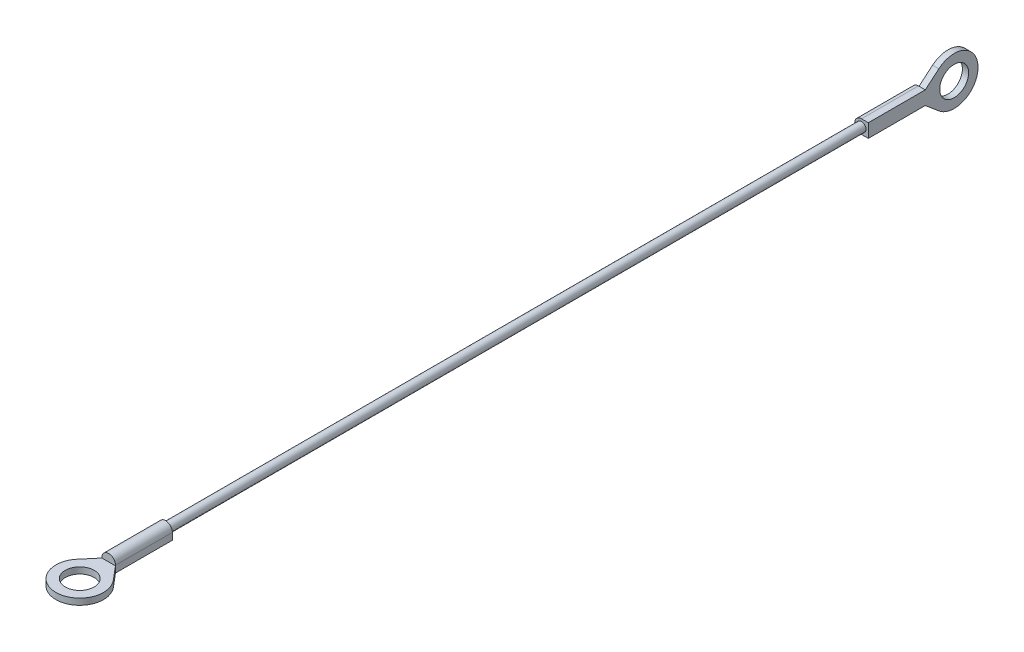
from build123d import *

# Parameters (mm, degrees)
SKETCH1_R           = 0.795
BOSS_EXTRUDE1_DEPTH = 61.12
BOSS_EXTRUDE2_DEPTH = 10
SKETCH3_R           = 2.54
BOSS_EXTRUDE3_DEPTH = 1.1
BOSS_EXTRUDE4_START = 10
BOSS_EXTRUDE4_DEPTH = 10
SKETCH5_R           = 2.54
BOSS_EXTRUDE5_DEPTH = 1.1


with BuildPart() as part:
    # Sketch1 → Boss-Extrude1 (new, symmetric)
    with BuildSketch(Plane.XY):
        with Locations(Location((0, 0, 0), (0, 0, 180))):
            Circle(SKETCH1_R)
    extrude(amount=BOSS_EXTRUDE1_DEPTH, both=True)

    # Sketch2 → Boss-Extrude2 (add)
    with BuildSketch(Plane.XY.offset(61.12)):
        with BuildLine():
            Line((-1.195, 0), (-1.195, -1.195))
            Line((-1.195, -1.195), (0, -1.195))
            Line((0, -1.195), (1.195, -1.195))
            Line((1.195, -1.195), (1.195, 0))
            ThreePointArc((1.195, 0), (0, 1.195), (-1.195, 0))
        make_face()
    extrude(amount=BOSS_EXTRUDE2_DEPTH)

    # Sketch3 → Boss-Extrude3 (add)
    with BuildSketch(Plane.XZ.offset(1.195)):
        with BuildLine():
            Line((1.195, 71.12), (3.201749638, 73.497242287))
            ThreePointArc((3.201749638, 73.497242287), (0, 80.39), (-3.201749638, 73.497242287))
            Line((-3.201749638, 73.497242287), (-1.195, 71.12))
            Line((-1.195, 71.12), (1.195, 71.12))
        make_face()
        with Locations(Location((0, 76.2, 0), (0, 0, 270))):
            Circle(SKETCH3_R, mode=Mode.SUBTRACT)
    extrude(amount=-BOSS_EXTRUDE3_DEPTH)

    # Sketch4 → Boss-Extrude4 (add)
    with BuildSketch(Plane(origin=(0, 0, -61.12), x_dir=(-1, 0, 0), z_dir=(0, 0, -1)).offset(BOSS_EXTRUDE4_START)):
        with BuildLine():
            Line((0, 1.195), (-1.195, 1.195))
            Line((-1.195, 1.195), (-1.195, 0))
            Line((-1.195, 0), (-1.195, -1.195))
            Line((-1.195, -1.195), (0, -1.195))
            ThreePointArc((0, -1.195), (1.195, 0), (0, 1.195))
        make_face()
    extrude(amount=-BOSS_EXTRUDE4_DEPTH)

    # Sketch5 → Boss-Extrude5 (add)
    with BuildSketch(Plane(origin=(1.195, 0, 0), x_dir=(0, 0, -1), z_dir=(1, 0, 0))):
        with BuildLine():
            Line((71.12, -1.195), (71.12, 1.195))
            Line((71.12, 1.195), (73.497242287, 3.201749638))
            ThreePointArc((73.497242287, 3.201749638), (80.39, 0), (73.497242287, -3.201749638))
            Line((73.497242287, -3.201749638), (71.12, -1.195))
        make_face()
        with Locations((76.2, 0)):
            Circle(SKETCH5_R, mode=Mode.SUBTRACT)
    extrude(amount=-BOSS_EXTRUDE5_DEPTH)


solid = part.part
